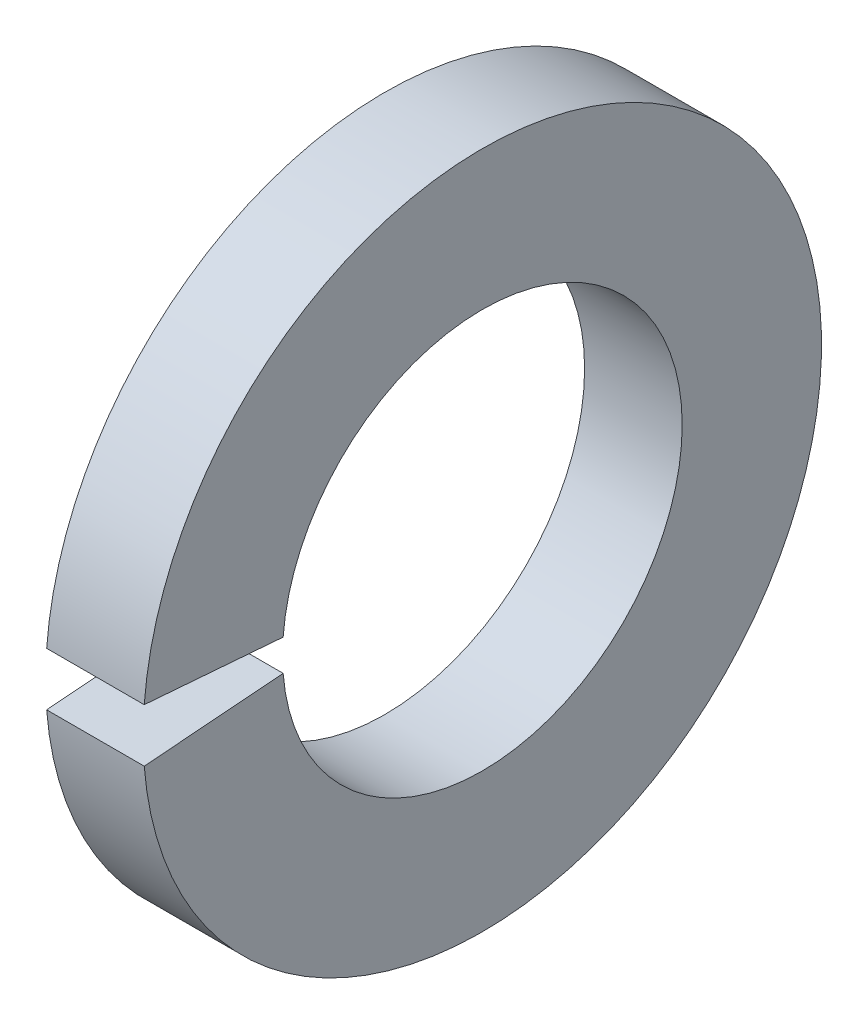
from build123d import *

# Parameters (mm, degrees)
SKETCH1_W = 3.175
SKETCH1_H = 4.5339
GAP_DEPTH = 16.927349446


with BuildPart() as part:
    # Sketch1 → Base-Revolve (revolve)
    with BuildSketch(Plane.XY, mode=Mode.PRIVATE) as base_revolve_sk:
        with Locations((-1.5875, 8.76935)):
            Rectangle(SKETCH1_W, SKETCH1_H)
    revolve(base_revolve_sk.sketch.rotate(Axis((-34.925, 0, 0), (1, 0, 0)), 90), axis=Axis((-34.925, 0, 0), (1, 0, 0)))

    # Sketch2 → Gap (cut, through all)
    with BuildSketch(Plane(origin=(0, 0, 0), x_dir=(0, -1, 0), z_dir=(-1, 0, 0))):
        with BuildLine():
            Line((0, 0), (0.883216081, 11.222324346))
            ThreePointArc((0.883216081, 11.222324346), (0, 11.257026), (-0.883216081, 11.222324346))
            Line((-0.883216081, 11.222324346), (0, 0))
        make_face()
    extrude(amount=GAP_DEPTH, mode=Mode.SUBTRACT)


solid = part.part
